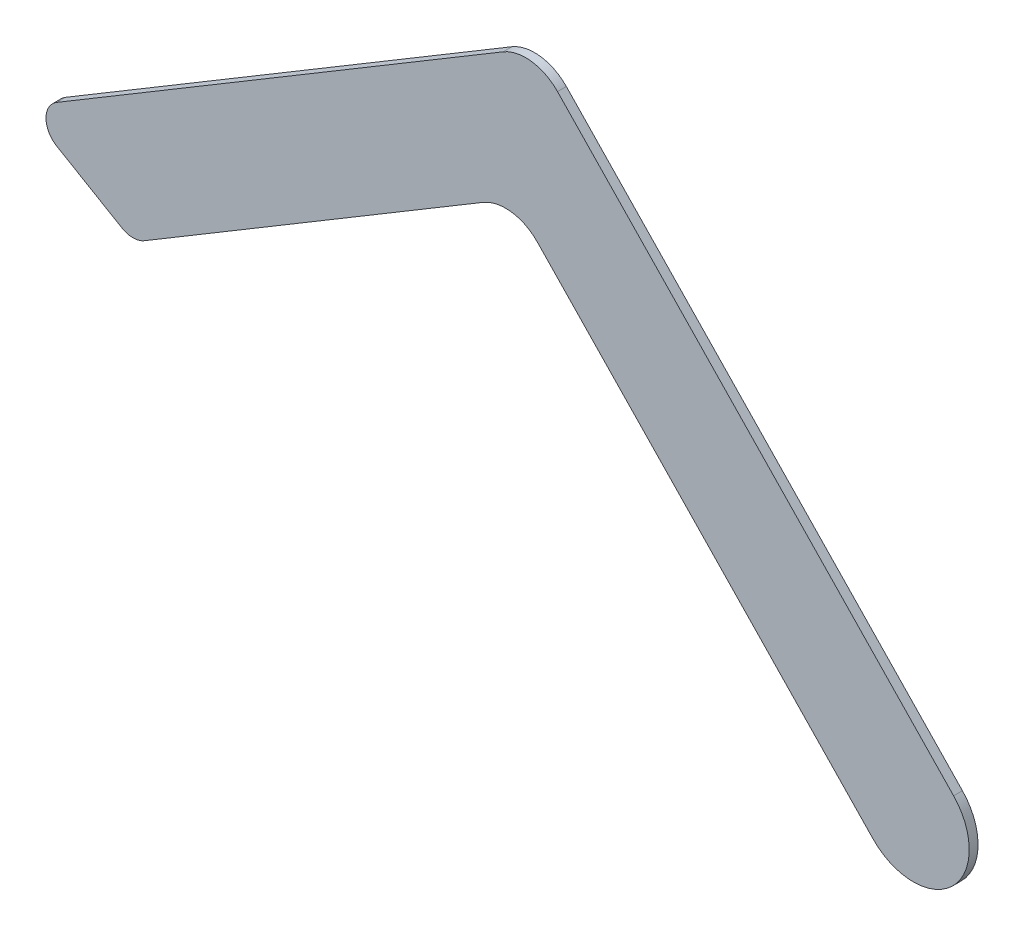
from build123d import *

# Parameters (mm, degrees)
AUFSATZ_LINEAR_AUSTRAGEN1_DEPTH = 4
SKALIEREN1_SCALE                = 1.19


with BuildPart() as part:
    # Skizze3 → Aufsatz-Linear austragen1 (new body)
    with BuildSketch(Plane.XY):
        with BuildLine():
            Line((197.505465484, 216.953198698), (352.3085305, 56.00209714))
            Line((352.3085305, 56.00209714), (377.222968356, 30.098177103))
            ThreePointArc((377.222968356, 30.098177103), (376.524329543, -5.782890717), (340.643261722, -5.084251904))
            Line((340.643261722, -5.084251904), (315.848957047, 20.694763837))
            Line((315.848957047, 20.694763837), (188.379522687, 153.226673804))
            ThreePointArc((188.379522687, 153.226673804), (176.615236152, 159.186123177), (163.698565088, 156.526596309))
            Line((163.698565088, 156.526596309), (10.029430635, 64.61383405))
            ThreePointArc((10.029430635, 64.61383405), (4.937529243, 63.19595358), (-0.165881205, 64.571833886))
            Line((-0.165881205, 64.571833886), (-29.668288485, 81.889428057))
            ThreePointArc((-29.668288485, 81.889428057), (-34.6059884, 90.472267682), (-29.739169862, 99.095497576))
            Line((-29.739169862, 99.095497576), (172.824507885, 220.253121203))
            ThreePointArc((172.824507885, 220.253121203), (185.741178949, 222.912648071), (197.505465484, 216.953198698))
        make_face()
    extrude(amount=AUFSATZ_LINEAR_AUSTRAGEN1_DEPTH)


with BuildPart() as part_1:
    # Skalieren1: scaled about (188.278244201, 115.890638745, 2)
    add(part.part.scale(SKALIEREN1_SCALE).moved(Location((-35.772866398, -22.019221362, -0.38))))


solid = part_1.part
